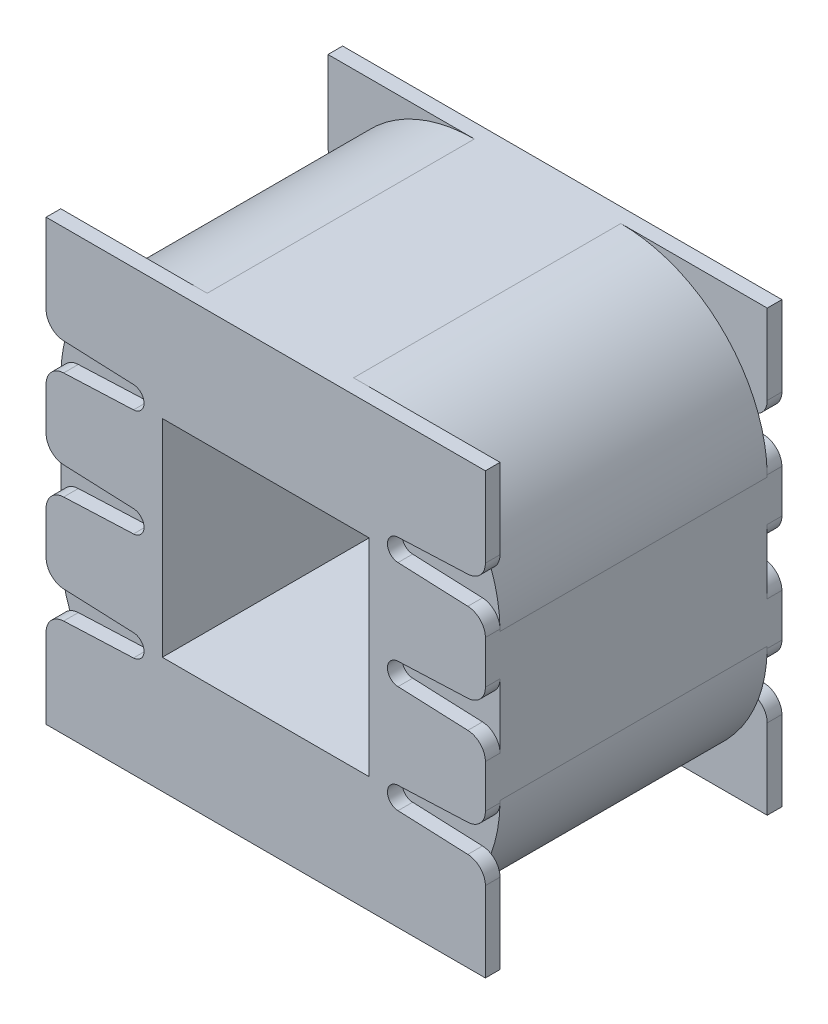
from build123d import *

# Parameters (mm, degrees)
ESQUISSE1_W                  = 11.3
ESQUISSE1_H                  = 11.3
EXTRUSION1_DEPTH             = 16.2
ENL_V_MAT_EXTRU_1_DEPTH      = 7.3
ENL_V_MAT_EXTRU_1_DEPTH_BACK = 7.3
ESQUISSE2_OUTSIDE_W          = 33.522
ESQUISSE2_OUTSIDE_H          = 33.522
ESQUISSE2_OUTSIDE_W_2        = 13.3
ESQUISSE2_OUTSIDE_H_2        = 13.3
EXTRUSION2_REACH             = 20.805
ESQUISSE3_W                  = 11.3
ESQUISSE3_H                  = 11.3
EXTRUSION2_DIRECTION_2_REACH = 20.805


with BuildPart() as part:
    # Esquisse1 → Extrusion1 (new body)
    with BuildSketch(Plane.XY):
        with BuildLine():
            Line((-12, 12), (12, 12))
            Line((12, 12), (12, 7.628988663))
            ThreePointArc((12, 7.628988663), (11.721751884, 6.936836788), (11.041851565, 6.629864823))
            Line((11.041851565, 6.629864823), (7.225393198, 6.47))
            ThreePointArc((7.225393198, 6.47), (6.65, 5.87), (7.225393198, 5.27))
            Line((7.225393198, 5.27), (11.041851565, 5.110135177))
            ThreePointArc((11.041851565, 5.110135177), (11.721751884, 4.803163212), (12, 4.111011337))
            Line((12, 4.111011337), (12, 1.758988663))
            ThreePointArc((12, 1.758988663), (11.721751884, 1.066836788), (11.041851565, 0.759864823))
            Line((11.041851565, 0.759864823), (7.225393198, 0.6))
            ThreePointArc((7.225393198, 0.6), (6.65, 0), (7.225393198, -0.6))
            Line((7.225393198, -0.6), (11.041851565, -0.759864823))
            ThreePointArc((11.041851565, -0.759864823), (11.721751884, -1.066836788), (12, -1.758988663))
            Line((12, -1.758988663), (12, -4.111011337))
            ThreePointArc((12, -4.111011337), (11.721751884, -4.803163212), (11.041851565, -5.110135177))
            Line((11.041851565, -5.110135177), (7.225393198, -5.27))
            ThreePointArc((7.225393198, -5.27), (6.65, -5.87), (7.225393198, -6.47))
            Line((7.225393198, -6.47), (11.041851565, -6.629864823))
            ThreePointArc((11.041851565, -6.629864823), (11.721751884, -6.936836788), (12, -7.628988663))
            Line((12, -7.628988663), (12, -12))
            Line((12, -12), (-12, -12))
            Line((-12, -12), (-12, -7.628988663))
            ThreePointArc((-12, -7.628988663), (-11.721751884, -6.936836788), (-11.041851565, -6.629864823))
            Line((-11.041851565, -6.629864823), (-7.225393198, -6.47))
            ThreePointArc((-7.225393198, -6.47), (-6.65, -5.87), (-7.225393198, -5.27))
            Line((-7.225393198, -5.27), (-11.041851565, -5.110135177))
            ThreePointArc((-11.041851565, -5.110135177), (-11.721751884, -4.803163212), (-12, -4.111011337))
            Line((-12, -4.111011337), (-12, -1.758988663))
            ThreePointArc((-12, -1.758988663), (-11.721751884, -1.066836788), (-11.041851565, -0.759864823))
            Line((-11.041851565, -0.759864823), (-7.225393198, -0.6))
            ThreePointArc((-7.225393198, -0.6), (-6.65, 0), (-7.225393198, 0.6))
            Line((-7.225393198, 0.6), (-11.041851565, 0.759864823))
            ThreePointArc((-11.041851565, 0.759864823), (-11.721751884, 1.066836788), (-12, 1.758988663))
            Line((-12, 1.758988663), (-12, 4.111011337))
            ThreePointArc((-12, 4.111011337), (-11.721751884, 4.803163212), (-11.041851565, 5.110135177))
            Line((-11.041851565, 5.110135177), (-7.225393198, 5.27))
            ThreePointArc((-7.225393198, 5.27), (-6.65, 5.87), (-7.225393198, 6.47))
            Line((-7.225393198, 6.47), (-11.041851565, 6.629864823))
            ThreePointArc((-11.041851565, 6.629864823), (-11.721751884, 6.936836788), (-12, 7.628988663))
            Line((-12, 7.628988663), (-12, 12))
        make_face()
        Rectangle(ESQUISSE1_W, ESQUISSE1_H, mode=Mode.SUBTRACT)
    extrude(amount=EXTRUSION1_DEPTH)

    # Esquisse2 outside → Enl_v. mat.-Extru.1 (cut, two sides: drawn at the far end of the back side and taken through both)
    with BuildSketch(Plane.XY.offset(8.1).offset(-ENL_V_MAT_EXTRU_1_DEPTH_BACK)):
        Rectangle(ESQUISSE2_OUTSIDE_W, ESQUISSE2_OUTSIDE_H)
        Rectangle(ESQUISSE2_OUTSIDE_W_2, ESQUISSE2_OUTSIDE_H_2, mode=Mode.SUBTRACT)
    extrude(amount=ENL_V_MAT_EXTRU_1_DEPTH + ENL_V_MAT_EXTRU_1_DEPTH_BACK, mode=Mode.SUBTRACT)

    # Extrusion2: up to this face of the body (flat: up to its plane)
    extrusion2_end = Plane(part.part.faces().sort_by_distance((0, 9.308195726, 15.4))[0])
    # Esquisse3 → Extrusion2 (add, up to the picked face)
    with BuildSketch(Plane.XY.offset(8.1), mode=Mode.PRIVATE) as extrusion2_sk1:
        with BuildLine():
            Line((-4, -12), (4, -12))
            ThreePointArc((4, -12), (9.656854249, -9.656854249), (12, -4))
            Line((12, -4), (12, 4))
            ThreePointArc((12, 4), (9.656854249, 9.656854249), (4, 12))
            Line((4, 12), (-4, 12))
            ThreePointArc((-4, 12), (-9.656854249, 9.656854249), (-12, 4))
            Line((-12, 4), (-12, -4))
            ThreePointArc((-12, -4), (-9.656854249, -9.656854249), (-4, -12))
        make_face()
        Rectangle(ESQUISSE3_W, ESQUISSE3_H, mode=Mode.SUBTRACT)
    extrusion2_tool1 = split(extrude(extrusion2_sk1.sketch, amount=EXTRUSION2_REACH, mode=Mode.PRIVATE), bisect_by=extrusion2_end, keep=Keep.BOTH, mode=Mode.PRIVATE)
    add(extrusion2_tool1.solids().sort_by(Axis((0, -11.660589, 8.1), (0, 0, 1)))[0])

    # Extrusion2 direction 2: up to this face of the body (flat: up to its plane)
    extrusion2_direction_2_end = Plane(part.part.faces().sort_by_distance((0, 9.308195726, 0.8))[0])
    # Esquisse3 → Extrusion2 direction 2 (add, up to the picked face)
    with BuildSketch(Plane.XY.offset(8.1), mode=Mode.PRIVATE) as extrusion2_direction_2_sk1:
        with BuildLine():
            Line((-4, -12), (4, -12))
            ThreePointArc((4, -12), (9.656854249, -9.656854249), (12, -4))
            Line((12, -4), (12, 4))
            ThreePointArc((12, 4), (9.656854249, 9.656854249), (4, 12))
            Line((4, 12), (-4, 12))
            ThreePointArc((-4, 12), (-9.656854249, 9.656854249), (-12, 4))
            Line((-12, 4), (-12, -4))
            ThreePointArc((-12, -4), (-9.656854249, -9.656854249), (-4, -12))
        make_face()
        Rectangle(ESQUISSE3_W, ESQUISSE3_H, mode=Mode.SUBTRACT)
    extrusion2_direction_2_tool1 = split(extrude(extrusion2_direction_2_sk1.sketch, amount=-EXTRUSION2_DIRECTION_2_REACH, mode=Mode.PRIVATE), bisect_by=extrusion2_direction_2_end, keep=Keep.BOTH, mode=Mode.PRIVATE)
    add(extrusion2_direction_2_tool1.solids().sort_by(Axis((0, -11.660589, 8.1), (0, 0, -1)))[0])


solid = part.part
